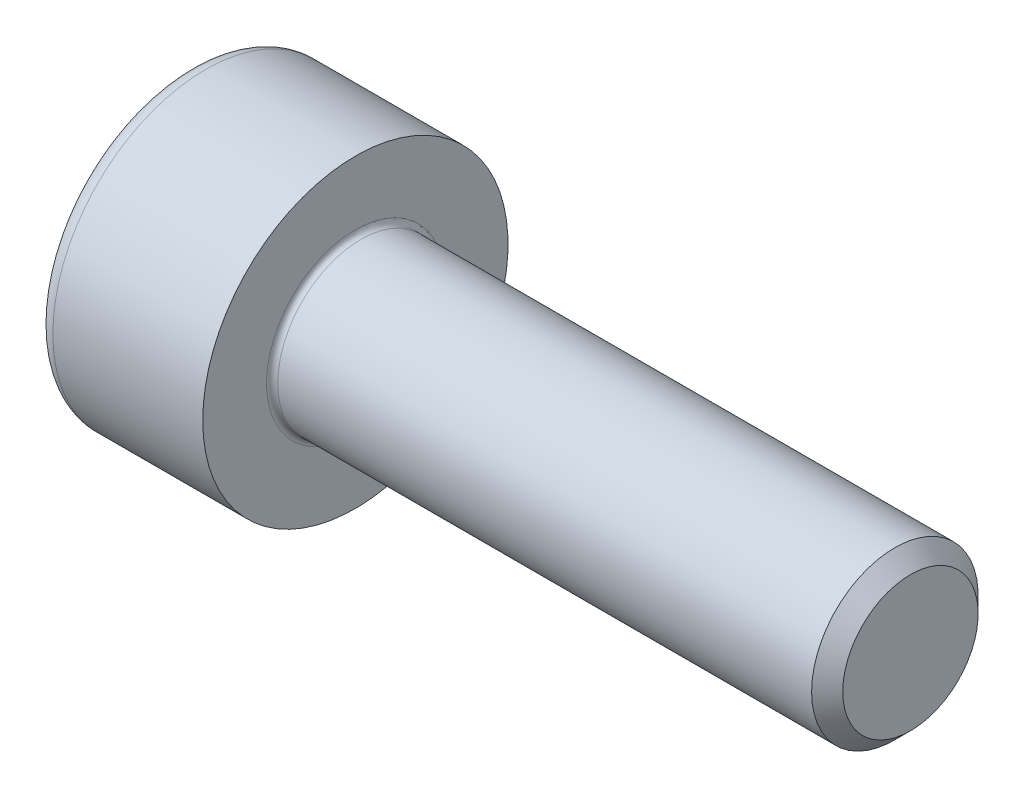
from build123d import *

# Parameters (mm, degrees)
FILLET1_R   = 0.1
FILLET2_R   = 0.3
HEX_2_DEPTH = 1.3


with BuildPart() as part:
    # BodySke → Base-Revolve (revolve)
    with BuildSketch(Plane.XY, mode=Mode.PRIVATE) as base_revolve_sk:
        Polygon((0, 0), (0, 2.75), (3, 2.75), (3, 1.5), (12.7195, 1.5), (13, 1.2195), (13, 0), align=None)
    revolve(base_revolve_sk.sketch.rotate(Axis((-31.75, 0, 0), (1, 0, 0)), 90), axis=Axis((-31.75, 0, 0), (1, 0, 0)))

    # Fillet1
    fillet1_edges = [part.edges().sort_by_distance(p)[0] for p in [
        (3, 0, -1.5),
    ]]
    fillet(fillet1_edges, radius=FILLET1_R)

    # Fillet2
    fillet2_edges = [part.edges().sort_by_distance(p)[0] for p in [
        (0, 0, -2.75),
    ]]
    fillet(fillet2_edges, radius=FILLET2_R)

    # Sketch2 → Hex-PreBroach (revolve, cut)
    with BuildSketch(Plane.XY, mode=Mode.PRIVATE) as hex_prebroach_sk:
        Polygon((0, 1.26), (1.3, 1.26), (2.027461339, 0), (0, 0), align=None)
    revolve(hex_prebroach_sk.sketch.rotate(Axis((0, 0, 0), (1, 0, 0)), 90), axis=Axis((0, 0, 0), (1, 0, 0)), mode=Mode.SUBTRACT)

    # Sketch3 → Hex 2 (cut)
    with BuildSketch(Plane(origin=(0, 0, 0), x_dir=(0, 0.500000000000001, 0.866025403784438), z_dir=(-1, 0, 0))):
        Polygon((0.727461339, 1.26), (-0.727461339, 1.26), (-1.454922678, 0), (-0.727461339, -1.26), (0.727461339, -1.26), (1.454922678, 0), align=None)
    extrude(amount=-HEX_2_DEPTH, mode=Mode.SUBTRACT)


solid = part.part
